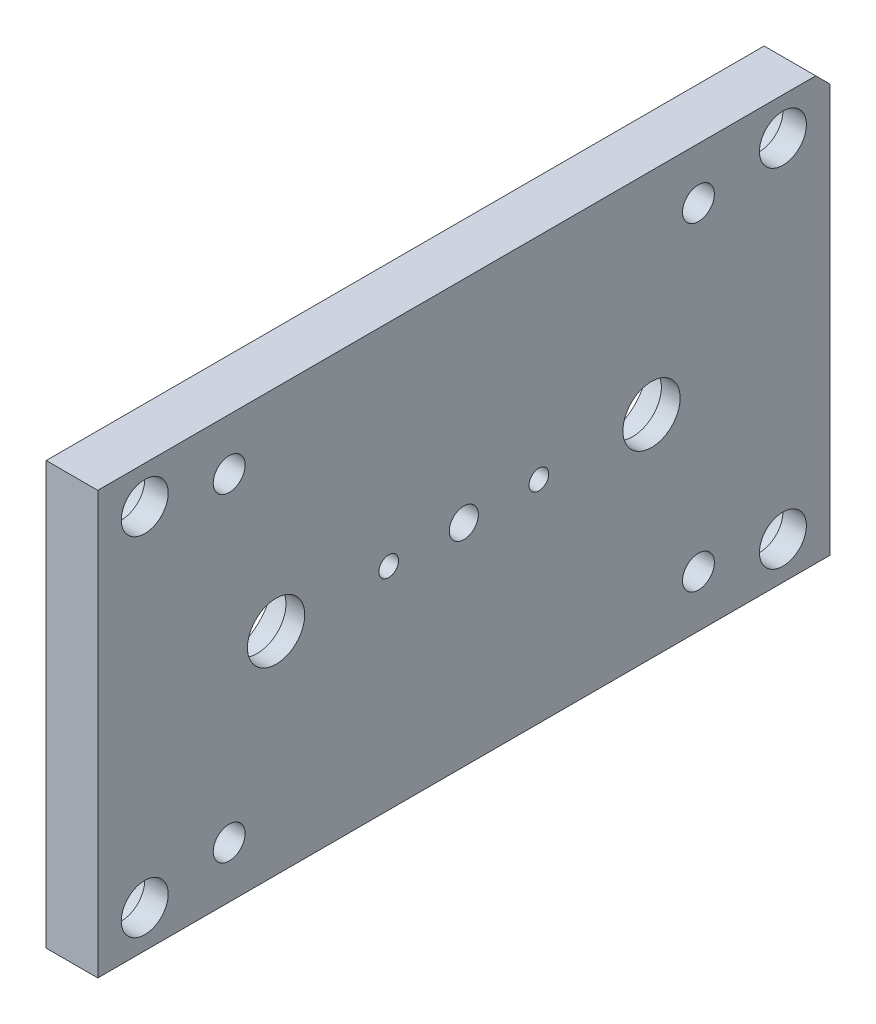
ISO-10303-21;
HEADER;
FILE_DESCRIPTION(('STEP AP214'),'2;1');
FILE_NAME('part.step','',(''),(''),'','','');
FILE_SCHEMA(('AUTOMOTIVE_DESIGN { 1 0 10303 214 1 1 1 1 }'));
ENDSEC;
DATA;
#1=APPLICATION_CONTEXT('core data for automotive mechanical design processes');
#2=APPLICATION_PROTOCOL_DEFINITION('international standard','automotive_design',2000,#1);
#3=PRODUCT_CONTEXT('',#1,'mechanical');
#4=PRODUCT('Part','Part','',(#3));
#5=PRODUCT_RELATED_PRODUCT_CATEGORY('part','',(#4));
#6=PRODUCT_DEFINITION_FORMATION('','',#4);
#7=PRODUCT_DEFINITION_CONTEXT('part definition',#1,'design');
#8=PRODUCT_DEFINITION('design','',#6,#7);
#9=PRODUCT_DEFINITION_SHAPE('','',#8);
#10=(LENGTH_UNIT() NAMED_UNIT(*) SI_UNIT(.MILLI.,.METRE.));
#11=(NAMED_UNIT(*) PLANE_ANGLE_UNIT() SI_UNIT($,.RADIAN.));
#12=(NAMED_UNIT(*) SI_UNIT($,.STERADIAN.) SOLID_ANGLE_UNIT());
#13=UNCERTAINTY_MEASURE_WITH_UNIT(LENGTH_MEASURE(1.E-05),#10,'distance_accuracy_value','');
#14=(GEOMETRIC_REPRESENTATION_CONTEXT(3) GLOBAL_UNCERTAINTY_ASSIGNED_CONTEXT((#13)) GLOBAL_UNIT_ASSIGNED_CONTEXT((#10,
#11,#12)) REPRESENTATION_CONTEXT('',''));
#15=CARTESIAN_POINT('',(0.,0.,0.));
#16=DIRECTION('',(0.,0.,1.));
#17=DIRECTION('',(1.,0.,0.));
#18=AXIS2_PLACEMENT_3D('',#15,#16,#17);
#19=CARTESIAN_POINT('',(11.,0.,40.));
#20=DIRECTION('',(-1.,0.,0.));
#21=DIRECTION('',(0.,0.,1.));
#22=AXIS2_PLACEMENT_3D('',#19,#20,#21);
#23=CYLINDRICAL_SURFACE('',#22,6.1);
#24=CARTESIAN_POINT('',(11.,0.,40.));
#25=DIRECTION('',(-1.,0.,0.));
#26=DIRECTION('',(0.,0.,1.));
#27=AXIS2_PLACEMENT_3D('',#24,#25,#26);
#28=CIRCLE('',#27,6.1);
#29=CARTESIAN_POINT('',(11.,0.,46.1));
#30=VERTEX_POINT('',#29);
#31=EDGE_CURVE('E239',#30,#30,#28,.T.);
#32=ORIENTED_EDGE('',*,*,#31,.F.);
#33=EDGE_LOOP('',(#32));
#34=FACE_BOUND('',#33,.T.);
#35=CARTESIAN_POINT('',(7.,0.,40.));
#36=DIRECTION('',(-1.,0.,0.));
#37=DIRECTION('',(0.,0.,1.));
#38=AXIS2_PLACEMENT_3D('',#35,#36,#37);
#39=CIRCLE('',#38,6.1);
#40=CARTESIAN_POINT('',(7.,0.,46.1));
#41=VERTEX_POINT('',#40);
#42=EDGE_CURVE('E152',#41,#41,#39,.F.);
#43=ORIENTED_EDGE('',*,*,#42,.F.);
#44=EDGE_LOOP('',(#43));
#45=FACE_BOUND('',#44,.T.);
#46=ADVANCED_FACE('F37',(#34,#45),#23,.F.);
#47=CARTESIAN_POINT('',(11.,0.,-40.));
#48=DIRECTION('',(-1.,0.,0.));
#49=DIRECTION('',(0.,0.,1.));
#50=AXIS2_PLACEMENT_3D('',#47,#48,#49);
#51=CYLINDRICAL_SURFACE('',#50,6.1);
#52=CARTESIAN_POINT('',(11.,0.,-40.));
#53=DIRECTION('',(-1.,0.,0.));
#54=DIRECTION('',(0.,0.,1.));
#55=AXIS2_PLACEMENT_3D('',#52,#53,#54);
#56=CIRCLE('',#55,6.1);
#57=CARTESIAN_POINT('',(11.,0.,-33.9));
#58=VERTEX_POINT('',#57);
#59=EDGE_CURVE('E245',#58,#58,#56,.T.);
#60=ORIENTED_EDGE('',*,*,#59,.F.);
#61=EDGE_LOOP('',(#60));
#62=FACE_BOUND('',#61,.T.);
#63=CARTESIAN_POINT('',(7.,0.,-40.));
#64=DIRECTION('',(-1.,0.,0.));
#65=DIRECTION('',(0.,0.,1.));
#66=AXIS2_PLACEMENT_3D('',#63,#64,#65);
#67=CIRCLE('',#66,6.1);
#68=CARTESIAN_POINT('',(7.,0.,-33.9));
#69=VERTEX_POINT('',#68);
#70=EDGE_CURVE('E147',#69,#69,#67,.F.);
#71=ORIENTED_EDGE('',*,*,#70,.F.);
#72=EDGE_LOOP('',(#71));
#73=FACE_BOUND('',#72,.T.);
#74=ADVANCED_FACE('F273',(#62,#73),#51,.F.);
#75=CARTESIAN_POINT('',(11.,0.,16.));
#76=DIRECTION('',(-1.,0.,0.));
#77=DIRECTION('',(0.,0.,1.));
#78=AXIS2_PLACEMENT_3D('',#75,#76,#77);
#79=CYLINDRICAL_SURFACE('',#78,2.1);
#80=CARTESIAN_POINT('',(11.,0.,16.));
#81=DIRECTION('',(-1.,0.,0.));
#82=DIRECTION('',(0.,0.,1.));
#83=AXIS2_PLACEMENT_3D('',#80,#81,#82);
#84=CIRCLE('',#83,2.1);
#85=CARTESIAN_POINT('',(11.,0.,18.1));
#86=VERTEX_POINT('',#85);
#87=EDGE_CURVE('E218',#86,#86,#84,.T.);
#88=ORIENTED_EDGE('',*,*,#87,.F.);
#89=EDGE_LOOP('',(#88));
#90=FACE_BOUND('',#89,.T.);
#91=CARTESIAN_POINT('',(4.,0.,16.));
#92=DIRECTION('',(-1.,0.,0.));
#93=DIRECTION('',(0.,0.,1.));
#94=AXIS2_PLACEMENT_3D('',#91,#92,#93);
#95=CIRCLE('',#94,2.1);
#96=CARTESIAN_POINT('',(4.,0.,18.1));
#97=VERTEX_POINT('',#96);
#98=EDGE_CURVE('E142',#97,#97,#95,.F.);
#99=ORIENTED_EDGE('',*,*,#98,.F.);
#100=EDGE_LOOP('',(#99));
#101=FACE_BOUND('',#100,.T.);
#102=ADVANCED_FACE('F279',(#90,#101),#79,.F.);
#103=CARTESIAN_POINT('',(11.,0.,-16.));
#104=DIRECTION('',(-1.,0.,0.));
#105=DIRECTION('',(0.,0.,1.));
#106=AXIS2_PLACEMENT_3D('',#103,#104,#105);
#107=CYLINDRICAL_SURFACE('',#106,2.1);
#108=CARTESIAN_POINT('',(11.,0.,-16.));
#109=DIRECTION('',(-1.,0.,0.));
#110=DIRECTION('',(0.,0.,1.));
#111=AXIS2_PLACEMENT_3D('',#108,#109,#110);
#112=CIRCLE('',#111,2.1);
#113=CARTESIAN_POINT('',(11.,0.,-13.9));
#114=VERTEX_POINT('',#113);
#115=EDGE_CURVE('E221',#114,#114,#112,.T.);
#116=ORIENTED_EDGE('',*,*,#115,.F.);
#117=EDGE_LOOP('',(#116));
#118=FACE_BOUND('',#117,.T.);
#119=CARTESIAN_POINT('',(4.,0.,-16.));
#120=DIRECTION('',(-1.,0.,0.));
#121=DIRECTION('',(0.,0.,1.));
#122=AXIS2_PLACEMENT_3D('',#119,#120,#121);
#123=CIRCLE('',#122,2.1);
#124=CARTESIAN_POINT('',(4.,0.,-13.9));
#125=VERTEX_POINT('',#124);
#126=EDGE_CURVE('E137',#125,#125,#123,.F.);
#127=ORIENTED_EDGE('',*,*,#126,.F.);
#128=EDGE_LOOP('',(#127));
#129=FACE_BOUND('',#128,.T.);
#130=ADVANCED_FACE('F401',(#118,#129),#107,.F.);
#131=CARTESIAN_POINT('',(11.,-37.,-68.));
#132=DIRECTION('',(-1.,0.,0.));
#133=DIRECTION('',(0.,0.,1.));
#134=AXIS2_PLACEMENT_3D('',#131,#132,#133);
#135=CYLINDRICAL_SURFACE('',#134,4.99999999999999);
#136=CARTESIAN_POINT('',(11.,-37.,-68.));
#137=DIRECTION('',(-1.,0.,0.));
#138=DIRECTION('',(0.,0.,1.));
#139=AXIS2_PLACEMENT_3D('',#136,#137,#138);
#140=CIRCLE('',#139,4.99999999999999);
#141=CARTESIAN_POINT('',(11.,-37.,-63.));
#142=VERTEX_POINT('',#141);
#143=EDGE_CURVE('E228',#142,#142,#140,.T.);
#144=ORIENTED_EDGE('',*,*,#143,.F.);
#145=EDGE_LOOP('',(#144));
#146=FACE_BOUND('',#145,.T.);
#147=CARTESIAN_POINT('',(6.,-37.,-68.));
#148=DIRECTION('',(-1.,0.,0.));
#149=DIRECTION('',(0.,0.,1.));
#150=AXIS2_PLACEMENT_3D('',#147,#148,#149);
#151=CIRCLE('',#150,4.99999999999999);
#152=CARTESIAN_POINT('',(6.,-37.,-63.));
#153=VERTEX_POINT('',#152);
#154=EDGE_CURVE('E132',#153,#153,#151,.F.);
#155=ORIENTED_EDGE('',*,*,#154,.F.);
#156=EDGE_LOOP('',(#155));
#157=FACE_BOUND('',#156,.T.);
#158=ADVANCED_FACE('F405',(#146,#157),#135,.F.);
#159=CARTESIAN_POINT('',(11.,-37.,68.));
#160=DIRECTION('',(-1.,0.,0.));
#161=DIRECTION('',(0.,0.,1.));
#162=AXIS2_PLACEMENT_3D('',#159,#160,#161);
#163=CYLINDRICAL_SURFACE('',#162,4.99999999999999);
#164=CARTESIAN_POINT('',(11.,-37.,68.));
#165=DIRECTION('',(-1.,0.,0.));
#166=DIRECTION('',(0.,0.,1.));
#167=AXIS2_PLACEMENT_3D('',#164,#165,#166);
#168=CIRCLE('',#167,4.99999999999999);
#169=CARTESIAN_POINT('',(11.,-37.,73.));
#170=VERTEX_POINT('',#169);
#171=EDGE_CURVE('E233',#170,#170,#168,.T.);
#172=ORIENTED_EDGE('',*,*,#171,.F.);
#173=EDGE_LOOP('',(#172));
#174=FACE_BOUND('',#173,.T.);
#175=CARTESIAN_POINT('',(6.,-37.,68.));
#176=DIRECTION('',(-1.,0.,0.));
#177=DIRECTION('',(0.,0.,1.));
#178=AXIS2_PLACEMENT_3D('',#175,#176,#177);
#179=CIRCLE('',#178,4.99999999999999);
#180=CARTESIAN_POINT('',(6.,-37.,73.));
#181=VERTEX_POINT('',#180);
#182=EDGE_CURVE('E127',#181,#181,#179,.F.);
#183=ORIENTED_EDGE('',*,*,#182,.F.);
#184=EDGE_LOOP('',(#183));
#185=FACE_BOUND('',#184,.T.);
#186=ADVANCED_FACE('F411',(#174,#185),#163,.F.);
#187=CARTESIAN_POINT('',(11.,37.,68.));
#188=DIRECTION('',(-1.,0.,0.));
#189=DIRECTION('',(0.,0.,1.));
#190=AXIS2_PLACEMENT_3D('',#187,#188,#189);
#191=CYLINDRICAL_SURFACE('',#190,4.99999999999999);
#192=CARTESIAN_POINT('',(11.,37.,68.));
#193=DIRECTION('',(-1.,0.,0.));
#194=DIRECTION('',(0.,0.,1.));
#195=AXIS2_PLACEMENT_3D('',#192,#193,#194);
#196=CIRCLE('',#195,4.99999999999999);
#197=CARTESIAN_POINT('',(11.,37.,73.));
#198=VERTEX_POINT('',#197);
#199=EDGE_CURVE('E236',#198,#198,#196,.T.);
#200=ORIENTED_EDGE('',*,*,#199,.F.);
#201=EDGE_LOOP('',(#200));
#202=FACE_BOUND('',#201,.T.);
#203=CARTESIAN_POINT('',(6.,37.,68.));
#204=DIRECTION('',(-1.,0.,0.));
#205=DIRECTION('',(0.,0.,1.));
#206=AXIS2_PLACEMENT_3D('',#203,#204,#205);
#207=CIRCLE('',#206,4.99999999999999);
#208=CARTESIAN_POINT('',(6.,37.,73.));
#209=VERTEX_POINT('',#208);
#210=EDGE_CURVE('E122',#209,#209,#207,.F.);
#211=ORIENTED_EDGE('',*,*,#210,.F.);
#212=EDGE_LOOP('',(#211));
#213=FACE_BOUND('',#212,.T.);
#214=ADVANCED_FACE('F286',(#202,#213),#191,.F.);
#215=CARTESIAN_POINT('',(11.,37.,-68.));
#216=DIRECTION('',(-1.,0.,0.));
#217=DIRECTION('',(0.,0.,1.));
#218=AXIS2_PLACEMENT_3D('',#215,#216,#217);
#219=CYLINDRICAL_SURFACE('',#218,4.99999999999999);
#220=CARTESIAN_POINT('',(11.,37.,-68.));
#221=DIRECTION('',(-1.,0.,0.));
#222=DIRECTION('',(0.,0.,1.));
#223=AXIS2_PLACEMENT_3D('',#220,#221,#222);
#224=CIRCLE('',#223,4.99999999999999);
#225=CARTESIAN_POINT('',(11.,37.,-63.));
#226=VERTEX_POINT('',#225);
#227=EDGE_CURVE('E242',#226,#226,#224,.T.);
#228=ORIENTED_EDGE('',*,*,#227,.F.);
#229=EDGE_LOOP('',(#228));
#230=FACE_BOUND('',#229,.T.);
#231=CARTESIAN_POINT('',(6.,37.,-68.));
#232=DIRECTION('',(-1.,0.,0.));
#233=DIRECTION('',(0.,0.,1.));
#234=AXIS2_PLACEMENT_3D('',#231,#232,#233);
#235=CIRCLE('',#234,4.99999999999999);
#236=CARTESIAN_POINT('',(6.,37.,-63.));
#237=VERTEX_POINT('',#236);
#238=EDGE_CURVE('E117',#237,#237,#235,.F.);
#239=ORIENTED_EDGE('',*,*,#238,.F.);
#240=EDGE_LOOP('',(#239));
#241=FACE_BOUND('',#240,.T.);
#242=ADVANCED_FACE('F288',(#230,#241),#219,.F.);
#243=CARTESIAN_POINT('',(11.,-45.,78.));
#244=DIRECTION('',(1.,0.,0.));
#245=DIRECTION('',(0.,0.,-1.));
#246=AXIS2_PLACEMENT_3D('',#243,#244,#245);
#247=PLANE('',#246);
#248=CARTESIAN_POINT('',(11.,34.,-50.));
#249=DIRECTION('',(-1.,0.,0.));
#250=DIRECTION('',(0.,0.,1.));
#251=AXIS2_PLACEMENT_3D('',#248,#249,#250);
#252=CIRCLE('',#251,3.4);
#253=CARTESIAN_POINT('',(11.,34.,-46.6));
#254=VERTEX_POINT('',#253);
#255=EDGE_CURVE('E200',#254,#254,#252,.T.);
#256=ORIENTED_EDGE('',*,*,#255,.T.);
#257=EDGE_LOOP('',(#256));
#258=FACE_BOUND('',#257,.T.);
#259=CARTESIAN_POINT('',(11.,-34.,50.));
#260=DIRECTION('',(-1.,0.,0.));
#261=DIRECTION('',(0.,0.,1.));
#262=AXIS2_PLACEMENT_3D('',#259,#260,#261);
#263=CIRCLE('',#262,3.4);
#264=CARTESIAN_POINT('',(11.,-34.,53.4));
#265=VERTEX_POINT('',#264);
#266=EDGE_CURVE('E212',#265,#265,#263,.T.);
#267=ORIENTED_EDGE('',*,*,#266,.T.);
#268=EDGE_LOOP('',(#267));
#269=FACE_BOUND('',#268,.T.);
#270=ORIENTED_EDGE('',*,*,#87,.T.);
#271=EDGE_LOOP('',(#270));
#272=FACE_BOUND('',#271,.T.);
#273=ORIENTED_EDGE('',*,*,#115,.T.);
#274=EDGE_LOOP('',(#273));
#275=FACE_BOUND('',#274,.T.);
#276=CARTESIAN_POINT('',(11.,0.,0.));
#277=DIRECTION('',(-1.,0.,0.));
#278=DIRECTION('',(0.,0.,1.));
#279=AXIS2_PLACEMENT_3D('',#276,#277,#278);
#280=CIRCLE('',#279,3.1);
#281=CARTESIAN_POINT('',(11.,0.,3.09999999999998));
#282=VERTEX_POINT('',#281);
#283=EDGE_CURVE('E225',#282,#282,#280,.T.);
#284=ORIENTED_EDGE('',*,*,#283,.T.);
#285=EDGE_LOOP('',(#284));
#286=FACE_BOUND('',#285,.T.);
#287=ORIENTED_EDGE('',*,*,#143,.T.);
#288=EDGE_LOOP('',(#287));
#289=FACE_BOUND('',#288,.T.);
#290=ORIENTED_EDGE('',*,*,#171,.T.);
#291=EDGE_LOOP('',(#290));
#292=FACE_BOUND('',#291,.T.);
#293=ORIENTED_EDGE('',*,*,#199,.T.);
#294=EDGE_LOOP('',(#293));
#295=FACE_BOUND('',#294,.T.);
#296=ORIENTED_EDGE('',*,*,#31,.T.);
#297=EDGE_LOOP('',(#296));
#298=FACE_BOUND('',#297,.T.);
#299=ORIENTED_EDGE('',*,*,#227,.T.);
#300=EDGE_LOOP('',(#299));
#301=FACE_BOUND('',#300,.T.);
#302=ORIENTED_EDGE('',*,*,#59,.T.);
#303=EDGE_LOOP('',(#302));
#304=FACE_BOUND('',#303,.T.);
#305=DIRECTION('',(0.,1.,0.));
#306=VECTOR('',#305,1.);
#307=CARTESIAN_POINT('',(11.,45.,-78.));
#308=LINE('',#307,#306);
#309=CARTESIAN_POINT('',(11.,-45.,-78.));
#310=VERTEX_POINT('',#309);
#311=CARTESIAN_POINT('',(11.,42.,-78.));
#312=VERTEX_POINT('',#311);
#313=EDGE_CURVE('E93',#310,#312,#308,.T.);
#314=ORIENTED_EDGE('',*,*,#313,.T.);
#315=DIRECTION('',(0.,-0.707106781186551,-0.707106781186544));
#316=VECTOR('',#315,1.);
#317=CARTESIAN_POINT('',(11.,76.4999999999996,-43.5000000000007));
#318=LINE('',#317,#316);
#319=CARTESIAN_POINT('',(11.,45.,-75.));
#320=VERTEX_POINT('',#319);
#321=EDGE_CURVE('E11',#312,#320,#318,.F.);
#322=ORIENTED_EDGE('',*,*,#321,.T.);
#323=DIRECTION('',(0.,0.,1.));
#324=VECTOR('',#323,1.);
#325=CARTESIAN_POINT('',(11.,45.,78.));
#326=LINE('',#325,#324);
#327=CARTESIAN_POINT('',(11.,45.,78.));
#328=VERTEX_POINT('',#327);
#329=EDGE_CURVE('E100',#320,#328,#326,.T.);
#330=ORIENTED_EDGE('',*,*,#329,.T.);
#331=DIRECTION('',(0.,-1.,0.));
#332=VECTOR('',#331,1.);
#333=CARTESIAN_POINT('',(11.,45.,78.));
#334=LINE('',#333,#332);
#335=CARTESIAN_POINT('',(11.,-45.,78.));
#336=VERTEX_POINT('',#335);
#337=EDGE_CURVE('E94',#328,#336,#334,.T.);
#338=ORIENTED_EDGE('',*,*,#337,.T.);
#339=DIRECTION('',(0.,0.,-1.));
#340=VECTOR('',#339,1.);
#341=CARTESIAN_POINT('',(11.,-45.,78.));
#342=LINE('',#341,#340);
#343=EDGE_CURVE('E84',#336,#310,#342,.T.);
#344=ORIENTED_EDGE('',*,*,#343,.T.);
#345=EDGE_LOOP('',(#314,#322,#330,#338,#344));
#346=FACE_BOUND('',#345,.T.);
#347=CARTESIAN_POINT('',(11.,-34.,-50.));
#348=DIRECTION('',(-1.,0.,0.));
#349=DIRECTION('',(0.,0.,1.));
#350=AXIS2_PLACEMENT_3D('',#347,#348,#349);
#351=CIRCLE('',#350,3.4);
#352=CARTESIAN_POINT('',(11.,-34.,-46.6));
#353=VERTEX_POINT('',#352);
#354=EDGE_CURVE('E206',#353,#353,#351,.T.);
#355=ORIENTED_EDGE('',*,*,#354,.T.);
#356=EDGE_LOOP('',(#355));
#357=FACE_BOUND('',#356,.T.);
#358=CARTESIAN_POINT('',(11.,34.,50.));
#359=DIRECTION('',(-1.,0.,0.));
#360=DIRECTION('',(0.,0.,1.));
#361=AXIS2_PLACEMENT_3D('',#358,#359,#360);
#362=CIRCLE('',#361,3.4);
#363=CARTESIAN_POINT('',(11.,34.,53.4));
#364=VERTEX_POINT('',#363);
#365=EDGE_CURVE('E120',#364,#364,#362,.T.);
#366=ORIENTED_EDGE('',*,*,#365,.T.);
#367=EDGE_LOOP('',(#366));
#368=FACE_BOUND('',#367,.T.);
#369=ADVANCED_FACE('F97',(#258,#269,#272,#275,#286,#289,#292,#295,#298,#301,#304,#346,#357,
#368),#247,.T.);
#370=CARTESIAN_POINT('',(11.,45.,78.));
#371=DIRECTION('',(0.,0.,-1.));
#372=DIRECTION('',(-1.,0.,0.));
#373=AXIS2_PLACEMENT_3D('',#370,#371,#372);
#374=PLANE('',#373);
#375=DIRECTION('',(0.,-1.,0.));
#376=VECTOR('',#375,1.);
#377=CARTESIAN_POINT('',(0.,45.,78.));
#378=LINE('',#377,#376);
#379=CARTESIAN_POINT('',(0.,45.,78.));
#380=VERTEX_POINT('',#379);
#381=CARTESIAN_POINT('',(0.,-45.,78.));
#382=VERTEX_POINT('',#381);
#383=EDGE_CURVE('E108',#380,#382,#378,.T.);
#384=ORIENTED_EDGE('',*,*,#383,.T.);
#385=DIRECTION('',(-1.,0.,0.));
#386=VECTOR('',#385,1.);
#387=CARTESIAN_POINT('',(11.,-45.,78.));
#388=LINE('',#387,#386);
#389=EDGE_CURVE('E88',#336,#382,#388,.T.);
#390=ORIENTED_EDGE('',*,*,#389,.F.);
#391=ORIENTED_EDGE('',*,*,#337,.F.);
#392=DIRECTION('',(-1.,0.,0.));
#393=VECTOR('',#392,1.);
#394=CARTESIAN_POINT('',(11.,45.,78.));
#395=LINE('',#394,#393);
#396=EDGE_CURVE('E113',#328,#380,#395,.T.);
#397=ORIENTED_EDGE('',*,*,#396,.T.);
#398=EDGE_LOOP('',(#384,#390,#391,#397));
#399=FACE_BOUND('',#398,.T.);
#400=ADVANCED_FACE('F106',(#399),#374,.F.);
#401=CARTESIAN_POINT('',(11.,-45.,78.));
#402=DIRECTION('',(0.,1.,0.));
#403=DIRECTION('',(0.,0.,1.));
#404=AXIS2_PLACEMENT_3D('',#401,#402,#403);
#405=PLANE('',#404);
#406=DIRECTION('',(0.,0.,-1.));
#407=VECTOR('',#406,1.);
#408=CARTESIAN_POINT('',(0.,-45.,78.));
#409=LINE('',#408,#407);
#410=CARTESIAN_POINT('',(0.,-45.,-78.));
#411=VERTEX_POINT('',#410);
#412=EDGE_CURVE('E251',#382,#411,#409,.T.);
#413=ORIENTED_EDGE('',*,*,#412,.T.);
#414=DIRECTION('',(-1.,0.,0.));
#415=VECTOR('',#414,1.);
#416=CARTESIAN_POINT('',(11.,-45.,-78.));
#417=LINE('',#416,#415);
#418=EDGE_CURVE('E91',#310,#411,#417,.T.);
#419=ORIENTED_EDGE('',*,*,#418,.F.);
#420=ORIENTED_EDGE('',*,*,#343,.F.);
#421=ORIENTED_EDGE('',*,*,#389,.T.);
#422=EDGE_LOOP('',(#413,#419,#420,#421));
#423=FACE_BOUND('',#422,.T.);
#424=ADVANCED_FACE('F86',(#423),#405,.F.);
#425=CARTESIAN_POINT('',(11.,45.,-78.));
#426=DIRECTION('',(0.,0.,1.));
#427=DIRECTION('',(1.,0.,0.));
#428=AXIS2_PLACEMENT_3D('',#425,#426,#427);
#429=PLANE('',#428);
#430=DIRECTION('',(0.,1.,0.));
#431=VECTOR('',#430,1.);
#432=CARTESIAN_POINT('',(0.,45.,-78.));
#433=LINE('',#432,#431);
#434=CARTESIAN_POINT('',(0.,42.,-78.));
#435=VERTEX_POINT('',#434);
#436=EDGE_CURVE('E253',#411,#435,#433,.T.);
#437=ORIENTED_EDGE('',*,*,#436,.T.);
#438=DIRECTION('',(1.,0.,0.));
#439=VECTOR('',#438,1.);
#440=CARTESIAN_POINT('',(11.,42.,-78.));
#441=LINE('',#440,#439);
#442=EDGE_CURVE('E45',#435,#312,#441,.T.);
#443=ORIENTED_EDGE('',*,*,#442,.T.);
#444=ORIENTED_EDGE('',*,*,#313,.F.);
#445=ORIENTED_EDGE('',*,*,#418,.T.);
#446=EDGE_LOOP('',(#437,#443,#444,#445));
#447=FACE_BOUND('',#446,.T.);
#448=ADVANCED_FACE('F257',(#447),#429,.F.);
#449=CARTESIAN_POINT('',(11.,45.,78.));
#450=DIRECTION('',(0.,-1.,0.));
#451=DIRECTION('',(0.,0.,-1.));
#452=AXIS2_PLACEMENT_3D('',#449,#450,#451);
#453=PLANE('',#452);
#454=ORIENTED_EDGE('',*,*,#329,.F.);
#455=DIRECTION('',(-1.,0.,0.));
#456=VECTOR('',#455,1.);
#457=CARTESIAN_POINT('',(11.,45.,-75.));
#458=LINE('',#457,#456);
#459=CARTESIAN_POINT('',(0.,45.,-75.));
#460=VERTEX_POINT('',#459);
#461=EDGE_CURVE('E109',#320,#460,#458,.T.);
#462=ORIENTED_EDGE('',*,*,#461,.T.);
#463=DIRECTION('',(0.,0.,1.));
#464=VECTOR('',#463,1.);
#465=CARTESIAN_POINT('',(0.,45.,78.));
#466=LINE('',#465,#464);
#467=EDGE_CURVE('E104',#460,#380,#466,.T.);
#468=ORIENTED_EDGE('',*,*,#467,.T.);
#469=ORIENTED_EDGE('',*,*,#396,.F.);
#470=EDGE_LOOP('',(#454,#462,#468,#469));
#471=FACE_BOUND('',#470,.T.);
#472=ADVANCED_FACE('F261',(#471),#453,.F.);
#473=CARTESIAN_POINT('',(0.,-45.,78.));
#474=DIRECTION('',(1.,0.,0.));
#475=DIRECTION('',(0.,0.,-1.));
#476=AXIS2_PLACEMENT_3D('',#473,#474,#475);
#477=PLANE('',#476);
#478=CARTESIAN_POINT('',(0.,0.,40.));
#479=DIRECTION('',(-1.,0.,0.));
#480=DIRECTION('',(0.,0.,1.));
#481=AXIS2_PLACEMENT_3D('',#478,#479,#480);
#482=CIRCLE('',#481,10.5);
#483=CARTESIAN_POINT('',(0.,0.,50.5));
#484=VERTEX_POINT('',#483);
#485=EDGE_CURVE('E162',#484,#484,#482,.T.);
#486=ORIENTED_EDGE('',*,*,#485,.F.);
#487=EDGE_LOOP('',(#486));
#488=FACE_BOUND('',#487,.T.);
#489=CARTESIAN_POINT('',(0.,0.,-40.));
#490=DIRECTION('',(-1.,0.,0.));
#491=DIRECTION('',(0.,0.,1.));
#492=AXIS2_PLACEMENT_3D('',#489,#490,#491);
#493=CIRCLE('',#492,10.5);
#494=CARTESIAN_POINT('',(0.,0.,-29.5));
#495=VERTEX_POINT('',#494);
#496=EDGE_CURVE('E154',#495,#495,#493,.T.);
#497=ORIENTED_EDGE('',*,*,#496,.F.);
#498=EDGE_LOOP('',(#497));
#499=FACE_BOUND('',#498,.T.);
#500=CARTESIAN_POINT('',(0.,0.,16.));
#501=DIRECTION('',(-1.,0.,0.));
#502=DIRECTION('',(0.,0.,1.));
#503=AXIS2_PLACEMENT_3D('',#500,#501,#502);
#504=CIRCLE('',#503,4.25);
#505=CARTESIAN_POINT('',(0.,0.,20.25));
#506=VERTEX_POINT('',#505);
#507=EDGE_CURVE('E150',#506,#506,#504,.T.);
#508=ORIENTED_EDGE('',*,*,#507,.F.);
#509=EDGE_LOOP('',(#508));
#510=FACE_BOUND('',#509,.T.);
#511=CARTESIAN_POINT('',(0.,0.,-16.));
#512=DIRECTION('',(-1.,0.,0.));
#513=DIRECTION('',(0.,0.,1.));
#514=AXIS2_PLACEMENT_3D('',#511,#512,#513);
#515=CIRCLE('',#514,4.25);
#516=CARTESIAN_POINT('',(0.,0.,-11.75));
#517=VERTEX_POINT('',#516);
#518=EDGE_CURVE('E145',#517,#517,#515,.T.);
#519=ORIENTED_EDGE('',*,*,#518,.F.);
#520=EDGE_LOOP('',(#519));
#521=FACE_BOUND('',#520,.T.);
#522=CARTESIAN_POINT('',(0.,-37.,-68.));
#523=DIRECTION('',(-1.,0.,0.));
#524=DIRECTION('',(0.,0.,1.));
#525=AXIS2_PLACEMENT_3D('',#522,#523,#524);
#526=CIRCLE('',#525,7.5);
#527=CARTESIAN_POINT('',(0.,-37.,-60.5));
#528=VERTEX_POINT('',#527);
#529=EDGE_CURVE('E140',#528,#528,#526,.T.);
#530=ORIENTED_EDGE('',*,*,#529,.F.);
#531=EDGE_LOOP('',(#530));
#532=FACE_BOUND('',#531,.T.);
#533=CARTESIAN_POINT('',(0.,-37.,68.));
#534=DIRECTION('',(-1.,0.,0.));
#535=DIRECTION('',(0.,0.,1.));
#536=AXIS2_PLACEMENT_3D('',#533,#534,#535);
#537=CIRCLE('',#536,7.50000000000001);
#538=CARTESIAN_POINT('',(0.,-37.,75.5));
#539=VERTEX_POINT('',#538);
#540=EDGE_CURVE('E135',#539,#539,#537,.T.);
#541=ORIENTED_EDGE('',*,*,#540,.F.);
#542=EDGE_LOOP('',(#541));
#543=FACE_BOUND('',#542,.T.);
#544=CARTESIAN_POINT('',(0.,37.,68.));
#545=DIRECTION('',(-1.,0.,0.));
#546=DIRECTION('',(0.,0.,1.));
#547=AXIS2_PLACEMENT_3D('',#544,#545,#546);
#548=CIRCLE('',#547,7.50000000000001);
#549=CARTESIAN_POINT('',(0.,37.,75.5));
#550=VERTEX_POINT('',#549);
#551=EDGE_CURVE('E130',#550,#550,#548,.T.);
#552=ORIENTED_EDGE('',*,*,#551,.F.);
#553=EDGE_LOOP('',(#552));
#554=FACE_BOUND('',#553,.T.);
#555=CARTESIAN_POINT('',(0.,37.,-68.));
#556=DIRECTION('',(-1.,0.,0.));
#557=DIRECTION('',(0.,0.,1.));
#558=AXIS2_PLACEMENT_3D('',#555,#556,#557);
#559=CIRCLE('',#558,7.5);
#560=CARTESIAN_POINT('',(0.,37.,-60.5));
#561=VERTEX_POINT('',#560);
#562=EDGE_CURVE('E125',#561,#561,#559,.T.);
#563=ORIENTED_EDGE('',*,*,#562,.F.);
#564=EDGE_LOOP('',(#563));
#565=FACE_BOUND('',#564,.T.);
#566=CARTESIAN_POINT('',(0.,34.,50.));
#567=DIRECTION('',(-1.,0.,0.));
#568=DIRECTION('',(0.,0.,1.));
#569=AXIS2_PLACEMENT_3D('',#566,#567,#568);
#570=CIRCLE('',#569,3.39999999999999);
#571=CARTESIAN_POINT('',(0.,34.,53.4));
#572=VERTEX_POINT('',#571);
#573=EDGE_CURVE('E197',#572,#572,#570,.T.);
#574=ORIENTED_EDGE('',*,*,#573,.F.);
#575=EDGE_LOOP('',(#574));
#576=FACE_BOUND('',#575,.T.);
#577=CARTESIAN_POINT('',(0.,34.,-50.));
#578=DIRECTION('',(-1.,0.,0.));
#579=DIRECTION('',(0.,0.,1.));
#580=AXIS2_PLACEMENT_3D('',#577,#578,#579);
#581=CIRCLE('',#580,3.39999999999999);
#582=CARTESIAN_POINT('',(0.,34.,-46.6));
#583=VERTEX_POINT('',#582);
#584=EDGE_CURVE('E203',#583,#583,#581,.T.);
#585=ORIENTED_EDGE('',*,*,#584,.F.);
#586=EDGE_LOOP('',(#585));
#587=FACE_BOUND('',#586,.T.);
#588=CARTESIAN_POINT('',(0.,-34.,-50.));
#589=DIRECTION('',(-1.,0.,0.));
#590=DIRECTION('',(0.,0.,1.));
#591=AXIS2_PLACEMENT_3D('',#588,#589,#590);
#592=CIRCLE('',#591,3.39999999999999);
#593=CARTESIAN_POINT('',(0.,-34.,-46.6));
#594=VERTEX_POINT('',#593);
#595=EDGE_CURVE('E209',#594,#594,#592,.T.);
#596=ORIENTED_EDGE('',*,*,#595,.F.);
#597=EDGE_LOOP('',(#596));
#598=FACE_BOUND('',#597,.T.);
#599=CARTESIAN_POINT('',(0.,-34.,50.));
#600=DIRECTION('',(-1.,0.,0.));
#601=DIRECTION('',(0.,0.,1.));
#602=AXIS2_PLACEMENT_3D('',#599,#600,#601);
#603=CIRCLE('',#602,3.39999999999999);
#604=CARTESIAN_POINT('',(0.,-34.,53.4));
#605=VERTEX_POINT('',#604);
#606=EDGE_CURVE('E215',#605,#605,#603,.T.);
#607=ORIENTED_EDGE('',*,*,#606,.F.);
#608=EDGE_LOOP('',(#607));
#609=FACE_BOUND('',#608,.T.);
#610=CARTESIAN_POINT('',(0.,0.,0.));
#611=DIRECTION('',(-1.,0.,0.));
#612=DIRECTION('',(0.,0.,1.));
#613=AXIS2_PLACEMENT_3D('',#610,#611,#612);
#614=CIRCLE('',#613,3.1);
#615=CARTESIAN_POINT('',(0.,0.,3.09999999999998));
#616=VERTEX_POINT('',#615);
#617=EDGE_CURVE('E224',#616,#616,#614,.T.);
#618=ORIENTED_EDGE('',*,*,#617,.F.);
#619=EDGE_LOOP('',(#618));
#620=FACE_BOUND('',#619,.T.);
#621=ORIENTED_EDGE('',*,*,#467,.F.);
#622=DIRECTION('',(0.,0.707106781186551,0.707106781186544));
#623=VECTOR('',#622,1.);
#624=CARTESIAN_POINT('',(0.,45.,-75.));
#625=LINE('',#624,#623);
#626=EDGE_CURVE('E59',#460,#435,#625,.F.);
#627=ORIENTED_EDGE('',*,*,#626,.T.);
#628=ORIENTED_EDGE('',*,*,#436,.F.);
#629=ORIENTED_EDGE('',*,*,#412,.F.);
#630=ORIENTED_EDGE('',*,*,#383,.F.);
#631=EDGE_LOOP('',(#621,#627,#628,#629,#630));
#632=FACE_BOUND('',#631,.T.);
#633=ADVANCED_FACE('F256',(#488,#499,#510,#521,#532,#543,#554,#565,#576,#587,#598,#609,#620,
#632),#477,.F.);
#634=CARTESIAN_POINT('',(11.,0.,0.));
#635=DIRECTION('',(-1.,0.,0.));
#636=DIRECTION('',(0.,0.,1.));
#637=AXIS2_PLACEMENT_3D('',#634,#635,#636);
#638=CYLINDRICAL_SURFACE('',#637,3.1);
#639=ORIENTED_EDGE('',*,*,#283,.F.);
#640=EDGE_LOOP('',(#639));
#641=FACE_BOUND('',#640,.T.);
#642=ORIENTED_EDGE('',*,*,#617,.T.);
#643=EDGE_LOOP('',(#642));
#644=FACE_BOUND('',#643,.T.);
#645=ADVANCED_FACE('F268',(#641,#644),#638,.F.);
#646=CARTESIAN_POINT('',(0.,-34.,50.));
#647=DIRECTION('',(-1.,0.,0.));
#648=DIRECTION('',(0.,0.,1.));
#649=AXIS2_PLACEMENT_3D('',#646,#647,#648);
#650=CYLINDRICAL_SURFACE('',#649,3.39999999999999);
#651=ORIENTED_EDGE('',*,*,#266,.F.);
#652=EDGE_LOOP('',(#651));
#653=FACE_BOUND('',#652,.T.);
#654=ORIENTED_EDGE('',*,*,#606,.T.);
#655=EDGE_LOOP('',(#654));
#656=FACE_BOUND('',#655,.T.);
#657=ADVANCED_FACE('F394',(#653,#656),#650,.F.);
#658=CARTESIAN_POINT('',(0.,-34.,-50.));
#659=DIRECTION('',(-1.,0.,0.));
#660=DIRECTION('',(0.,0.,1.));
#661=AXIS2_PLACEMENT_3D('',#658,#659,#660);
#662=CYLINDRICAL_SURFACE('',#661,3.39999999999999);
#663=ORIENTED_EDGE('',*,*,#354,.F.);
#664=EDGE_LOOP('',(#663));
#665=FACE_BOUND('',#664,.T.);
#666=ORIENTED_EDGE('',*,*,#595,.T.);
#667=EDGE_LOOP('',(#666));
#668=FACE_BOUND('',#667,.T.);
#669=ADVANCED_FACE('F390',(#665,#668),#662,.F.);
#670=CARTESIAN_POINT('',(0.,34.,-50.));
#671=DIRECTION('',(-1.,0.,0.));
#672=DIRECTION('',(0.,0.,1.));
#673=AXIS2_PLACEMENT_3D('',#670,#671,#672);
#674=CYLINDRICAL_SURFACE('',#673,3.39999999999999);
#675=ORIENTED_EDGE('',*,*,#255,.F.);
#676=EDGE_LOOP('',(#675));
#677=FACE_BOUND('',#676,.T.);
#678=ORIENTED_EDGE('',*,*,#584,.T.);
#679=EDGE_LOOP('',(#678));
#680=FACE_BOUND('',#679,.T.);
#681=ADVANCED_FACE('F386',(#677,#680),#674,.F.);
#682=CARTESIAN_POINT('',(0.,34.,50.));
#683=DIRECTION('',(-1.,0.,0.));
#684=DIRECTION('',(0.,0.,1.));
#685=AXIS2_PLACEMENT_3D('',#682,#683,#684);
#686=CYLINDRICAL_SURFACE('',#685,3.39999999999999);
#687=ORIENTED_EDGE('',*,*,#365,.F.);
#688=EDGE_LOOP('',(#687));
#689=FACE_BOUND('',#688,.T.);
#690=ORIENTED_EDGE('',*,*,#573,.T.);
#691=EDGE_LOOP('',(#690));
#692=FACE_BOUND('',#691,.T.);
#693=ADVANCED_FACE('F379',(#689,#692),#686,.F.);
#694=CARTESIAN_POINT('',(6.,37.,-68.));
#695=DIRECTION('',(-1.,0.,0.));
#696=DIRECTION('',(0.,0.,1.));
#697=AXIS2_PLACEMENT_3D('',#694,#695,#696);
#698=PLANE('',#697);
#699=CARTESIAN_POINT('',(6.,37.,-68.));
#700=DIRECTION('',(-1.,0.,0.));
#701=DIRECTION('',(0.,0.,1.));
#702=AXIS2_PLACEMENT_3D('',#699,#700,#701);
#703=CIRCLE('',#702,7.5);
#704=CARTESIAN_POINT('',(6.,37.,-60.5));
#705=VERTEX_POINT('',#704);
#706=EDGE_CURVE('E121',#705,#705,#703,.T.);
#707=ORIENTED_EDGE('',*,*,#706,.T.);
#708=EDGE_LOOP('',(#707));
#709=FACE_BOUND('',#708,.T.);
#710=ORIENTED_EDGE('',*,*,#238,.T.);
#711=EDGE_LOOP('',(#710));
#712=FACE_BOUND('',#711,.T.);
#713=ADVANCED_FACE('F376',(#709,#712),#698,.T.);
#714=CARTESIAN_POINT('',(6.,37.,-68.));
#715=DIRECTION('',(-1.,0.,0.));
#716=DIRECTION('',(0.,0.,1.));
#717=AXIS2_PLACEMENT_3D('',#714,#715,#716);
#718=CYLINDRICAL_SURFACE('',#717,7.5);
#719=ORIENTED_EDGE('',*,*,#706,.F.);
#720=EDGE_LOOP('',(#719));
#721=FACE_BOUND('',#720,.T.);
#722=ORIENTED_EDGE('',*,*,#562,.T.);
#723=EDGE_LOOP('',(#722));
#724=FACE_BOUND('',#723,.T.);
#725=ADVANCED_FACE('F371',(#721,#724),#718,.F.);
#726=CARTESIAN_POINT('',(6.,37.,68.));
#727=DIRECTION('',(-1.,0.,0.));
#728=DIRECTION('',(0.,0.,1.));
#729=AXIS2_PLACEMENT_3D('',#726,#727,#728);
#730=PLANE('',#729);
#731=CARTESIAN_POINT('',(6.,37.,68.));
#732=DIRECTION('',(-1.,0.,0.));
#733=DIRECTION('',(0.,0.,1.));
#734=AXIS2_PLACEMENT_3D('',#731,#732,#733);
#735=CIRCLE('',#734,7.50000000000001);
#736=CARTESIAN_POINT('',(6.,37.,75.5));
#737=VERTEX_POINT('',#736);
#738=EDGE_CURVE('E126',#737,#737,#735,.T.);
#739=ORIENTED_EDGE('',*,*,#738,.T.);
#740=EDGE_LOOP('',(#739));
#741=FACE_BOUND('',#740,.T.);
#742=ORIENTED_EDGE('',*,*,#210,.T.);
#743=EDGE_LOOP('',(#742));
#744=FACE_BOUND('',#743,.T.);
#745=ADVANCED_FACE('F368',(#741,#744),#730,.T.);
#746=CARTESIAN_POINT('',(6.,37.,68.));
#747=DIRECTION('',(-1.,0.,0.));
#748=DIRECTION('',(0.,0.,1.));
#749=AXIS2_PLACEMENT_3D('',#746,#747,#748);
#750=CYLINDRICAL_SURFACE('',#749,7.50000000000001);
#751=ORIENTED_EDGE('',*,*,#738,.F.);
#752=EDGE_LOOP('',(#751));
#753=FACE_BOUND('',#752,.T.);
#754=ORIENTED_EDGE('',*,*,#551,.T.);
#755=EDGE_LOOP('',(#754));
#756=FACE_BOUND('',#755,.T.);
#757=ADVANCED_FACE('F363',(#753,#756),#750,.F.);
#758=CARTESIAN_POINT('',(6.,-37.,68.));
#759=DIRECTION('',(-1.,0.,0.));
#760=DIRECTION('',(0.,0.,1.));
#761=AXIS2_PLACEMENT_3D('',#758,#759,#760);
#762=PLANE('',#761);
#763=CARTESIAN_POINT('',(6.,-37.,68.));
#764=DIRECTION('',(-1.,0.,0.));
#765=DIRECTION('',(0.,0.,1.));
#766=AXIS2_PLACEMENT_3D('',#763,#764,#765);
#767=CIRCLE('',#766,7.50000000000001);
#768=CARTESIAN_POINT('',(6.,-37.,75.5));
#769=VERTEX_POINT('',#768);
#770=EDGE_CURVE('E131',#769,#769,#767,.T.);
#771=ORIENTED_EDGE('',*,*,#770,.T.);
#772=EDGE_LOOP('',(#771));
#773=FACE_BOUND('',#772,.T.);
#774=ORIENTED_EDGE('',*,*,#182,.T.);
#775=EDGE_LOOP('',(#774));
#776=FACE_BOUND('',#775,.T.);
#777=ADVANCED_FACE('F360',(#773,#776),#762,.T.);
#778=CARTESIAN_POINT('',(6.,-37.,68.));
#779=DIRECTION('',(-1.,0.,0.));
#780=DIRECTION('',(0.,0.,1.));
#781=AXIS2_PLACEMENT_3D('',#778,#779,#780);
#782=CYLINDRICAL_SURFACE('',#781,7.50000000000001);
#783=ORIENTED_EDGE('',*,*,#770,.F.);
#784=EDGE_LOOP('',(#783));
#785=FACE_BOUND('',#784,.T.);
#786=ORIENTED_EDGE('',*,*,#540,.T.);
#787=EDGE_LOOP('',(#786));
#788=FACE_BOUND('',#787,.T.);
#789=ADVANCED_FACE('F355',(#785,#788),#782,.F.);
#790=CARTESIAN_POINT('',(6.,-37.,-68.));
#791=DIRECTION('',(-1.,0.,0.));
#792=DIRECTION('',(0.,0.,1.));
#793=AXIS2_PLACEMENT_3D('',#790,#791,#792);
#794=PLANE('',#793);
#795=CARTESIAN_POINT('',(6.,-37.,-68.));
#796=DIRECTION('',(-1.,0.,0.));
#797=DIRECTION('',(0.,0.,1.));
#798=AXIS2_PLACEMENT_3D('',#795,#796,#797);
#799=CIRCLE('',#798,7.5);
#800=CARTESIAN_POINT('',(6.,-37.,-60.5));
#801=VERTEX_POINT('',#800);
#802=EDGE_CURVE('E136',#801,#801,#799,.T.);
#803=ORIENTED_EDGE('',*,*,#802,.T.);
#804=EDGE_LOOP('',(#803));
#805=FACE_BOUND('',#804,.T.);
#806=ORIENTED_EDGE('',*,*,#154,.T.);
#807=EDGE_LOOP('',(#806));
#808=FACE_BOUND('',#807,.T.);
#809=ADVANCED_FACE('F352',(#805,#808),#794,.T.);
#810=CARTESIAN_POINT('',(6.,-37.,-68.));
#811=DIRECTION('',(-1.,0.,0.));
#812=DIRECTION('',(0.,0.,1.));
#813=AXIS2_PLACEMENT_3D('',#810,#811,#812);
#814=CYLINDRICAL_SURFACE('',#813,7.5);
#815=ORIENTED_EDGE('',*,*,#802,.F.);
#816=EDGE_LOOP('',(#815));
#817=FACE_BOUND('',#816,.T.);
#818=ORIENTED_EDGE('',*,*,#529,.T.);
#819=EDGE_LOOP('',(#818));
#820=FACE_BOUND('',#819,.T.);
#821=ADVANCED_FACE('F347',(#817,#820),#814,.F.);
#822=CARTESIAN_POINT('',(4.,0.,-16.));
#823=DIRECTION('',(-1.,0.,0.));
#824=DIRECTION('',(0.,0.,1.));
#825=AXIS2_PLACEMENT_3D('',#822,#823,#824);
#826=PLANE('',#825);
#827=CARTESIAN_POINT('',(4.,0.,-16.));
#828=DIRECTION('',(-1.,0.,0.));
#829=DIRECTION('',(0.,0.,1.));
#830=AXIS2_PLACEMENT_3D('',#827,#828,#829);
#831=CIRCLE('',#830,4.25);
#832=CARTESIAN_POINT('',(4.,0.,-11.75));
#833=VERTEX_POINT('',#832);
#834=EDGE_CURVE('E141',#833,#833,#831,.T.);
#835=ORIENTED_EDGE('',*,*,#834,.T.);
#836=EDGE_LOOP('',(#835));
#837=FACE_BOUND('',#836,.T.);
#838=ORIENTED_EDGE('',*,*,#126,.T.);
#839=EDGE_LOOP('',(#838));
#840=FACE_BOUND('',#839,.T.);
#841=ADVANCED_FACE('F344',(#837,#840),#826,.T.);
#842=CARTESIAN_POINT('',(4.,0.,-16.));
#843=DIRECTION('',(-1.,0.,0.));
#844=DIRECTION('',(0.,0.,1.));
#845=AXIS2_PLACEMENT_3D('',#842,#843,#844);
#846=CYLINDRICAL_SURFACE('',#845,4.25);
#847=ORIENTED_EDGE('',*,*,#834,.F.);
#848=EDGE_LOOP('',(#847));
#849=FACE_BOUND('',#848,.T.);
#850=ORIENTED_EDGE('',*,*,#518,.T.);
#851=EDGE_LOOP('',(#850));
#852=FACE_BOUND('',#851,.T.);
#853=ADVANCED_FACE('F341',(#849,#852),#846,.F.);
#854=CARTESIAN_POINT('',(4.,0.,16.));
#855=DIRECTION('',(-1.,0.,0.));
#856=DIRECTION('',(0.,0.,1.));
#857=AXIS2_PLACEMENT_3D('',#854,#855,#856);
#858=PLANE('',#857);
#859=CARTESIAN_POINT('',(4.,0.,16.));
#860=DIRECTION('',(-1.,0.,0.));
#861=DIRECTION('',(0.,0.,1.));
#862=AXIS2_PLACEMENT_3D('',#859,#860,#861);
#863=CIRCLE('',#862,4.25);
#864=CARTESIAN_POINT('',(4.,0.,20.25));
#865=VERTEX_POINT('',#864);
#866=EDGE_CURVE('E146',#865,#865,#863,.T.);
#867=ORIENTED_EDGE('',*,*,#866,.T.);
#868=EDGE_LOOP('',(#867));
#869=FACE_BOUND('',#868,.T.);
#870=ORIENTED_EDGE('',*,*,#98,.T.);
#871=EDGE_LOOP('',(#870));
#872=FACE_BOUND('',#871,.T.);
#873=ADVANCED_FACE('F333',(#869,#872),#858,.T.);
#874=CARTESIAN_POINT('',(4.,0.,16.));
#875=DIRECTION('',(-1.,0.,0.));
#876=DIRECTION('',(0.,0.,1.));
#877=AXIS2_PLACEMENT_3D('',#874,#875,#876);
#878=CYLINDRICAL_SURFACE('',#877,4.25);
#879=ORIENTED_EDGE('',*,*,#866,.F.);
#880=EDGE_LOOP('',(#879));
#881=FACE_BOUND('',#880,.T.);
#882=ORIENTED_EDGE('',*,*,#507,.T.);
#883=EDGE_LOOP('',(#882));
#884=FACE_BOUND('',#883,.T.);
#885=ADVANCED_FACE('F323',(#881,#884),#878,.F.);
#886=CARTESIAN_POINT('',(7.,0.,-40.));
#887=DIRECTION('',(-1.,0.,0.));
#888=DIRECTION('',(0.,0.,1.));
#889=AXIS2_PLACEMENT_3D('',#886,#887,#888);
#890=PLANE('',#889);
#891=CARTESIAN_POINT('',(7.,0.,-40.));
#892=DIRECTION('',(-1.,0.,0.));
#893=DIRECTION('',(0.,0.,1.));
#894=AXIS2_PLACEMENT_3D('',#891,#892,#893);
#895=CIRCLE('',#894,10.5);
#896=CARTESIAN_POINT('',(7.,0.,-29.5));
#897=VERTEX_POINT('',#896);
#898=EDGE_CURVE('E151',#897,#897,#895,.T.);
#899=ORIENTED_EDGE('',*,*,#898,.T.);
#900=EDGE_LOOP('',(#899));
#901=FACE_BOUND('',#900,.T.);
#902=ORIENTED_EDGE('',*,*,#70,.T.);
#903=EDGE_LOOP('',(#902));
#904=FACE_BOUND('',#903,.T.);
#905=ADVANCED_FACE('F320',(#901,#904),#890,.T.);
#906=CARTESIAN_POINT('',(7.,0.,-40.));
#907=DIRECTION('',(-1.,0.,0.));
#908=DIRECTION('',(0.,0.,1.));
#909=AXIS2_PLACEMENT_3D('',#906,#907,#908);
#910=CYLINDRICAL_SURFACE('',#909,10.5);
#911=ORIENTED_EDGE('',*,*,#898,.F.);
#912=EDGE_LOOP('',(#911));
#913=FACE_BOUND('',#912,.T.);
#914=ORIENTED_EDGE('',*,*,#496,.T.);
#915=EDGE_LOOP('',(#914));
#916=FACE_BOUND('',#915,.T.);
#917=ADVANCED_FACE('F322',(#913,#916),#910,.F.);
#918=CARTESIAN_POINT('',(7.,0.,40.));
#919=DIRECTION('',(-1.,0.,0.));
#920=DIRECTION('',(0.,0.,1.));
#921=AXIS2_PLACEMENT_3D('',#918,#919,#920);
#922=PLANE('',#921);
#923=CARTESIAN_POINT('',(7.,0.,40.));
#924=DIRECTION('',(-1.,0.,0.));
#925=DIRECTION('',(0.,0.,1.));
#926=AXIS2_PLACEMENT_3D('',#923,#924,#925);
#927=CIRCLE('',#926,10.5);
#928=CARTESIAN_POINT('',(7.,0.,50.5));
#929=VERTEX_POINT('',#928);
#930=EDGE_CURVE('E155',#929,#929,#927,.T.);
#931=ORIENTED_EDGE('',*,*,#930,.T.);
#932=EDGE_LOOP('',(#931));
#933=FACE_BOUND('',#932,.T.);
#934=ORIENTED_EDGE('',*,*,#42,.T.);
#935=EDGE_LOOP('',(#934));
#936=FACE_BOUND('',#935,.T.);
#937=ADVANCED_FACE('F330',(#933,#936),#922,.T.);
#938=CARTESIAN_POINT('',(7.,0.,40.));
#939=DIRECTION('',(-1.,0.,0.));
#940=DIRECTION('',(0.,0.,1.));
#941=AXIS2_PLACEMENT_3D('',#938,#939,#940);
#942=CYLINDRICAL_SURFACE('',#941,10.5);
#943=ORIENTED_EDGE('',*,*,#930,.F.);
#944=EDGE_LOOP('',(#943));
#945=FACE_BOUND('',#944,.T.);
#946=ORIENTED_EDGE('',*,*,#485,.T.);
#947=EDGE_LOOP('',(#946));
#948=FACE_BOUND('',#947,.T.);
#949=ADVANCED_FACE('F337',(#945,#948),#942,.F.);
#950=CARTESIAN_POINT('',(11.,45.,-75.));
#951=DIRECTION('',(0.,-0.707106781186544,0.707106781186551));
#952=DIRECTION('',(0.,-0.707106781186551,-0.707106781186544));
#953=AXIS2_PLACEMENT_3D('',#950,#951,#952);
#954=PLANE('',#953);
#955=ORIENTED_EDGE('',*,*,#321,.F.);
#956=ORIENTED_EDGE('',*,*,#442,.F.);
#957=ORIENTED_EDGE('',*,*,#626,.F.);
#958=ORIENTED_EDGE('',*,*,#461,.F.);
#959=EDGE_LOOP('',(#955,#956,#957,#958));
#960=FACE_BOUND('',#959,.T.);
#961=ADVANCED_FACE('F39',(#960),#954,.F.);
#962=CLOSED_SHELL('',(#46,#74,#102,#130,#158,#186,#214,#242,#369,#400,#424,#448,#472,#633,#645,
#657,#669,#681,#693,#713,#725,#745,#757,#777,#789,#809,#821,#841,#853,#873,#885,#905,#917,#937,
#949,#961));
#963=MANIFOLD_SOLID_BREP('B2',#962);
#964=ADVANCED_BREP_SHAPE_REPRESENTATION('',(#18,#963),#14);
#965=SHAPE_DEFINITION_REPRESENTATION(#9,#964);
ENDSEC;
END-ISO-10303-21;
